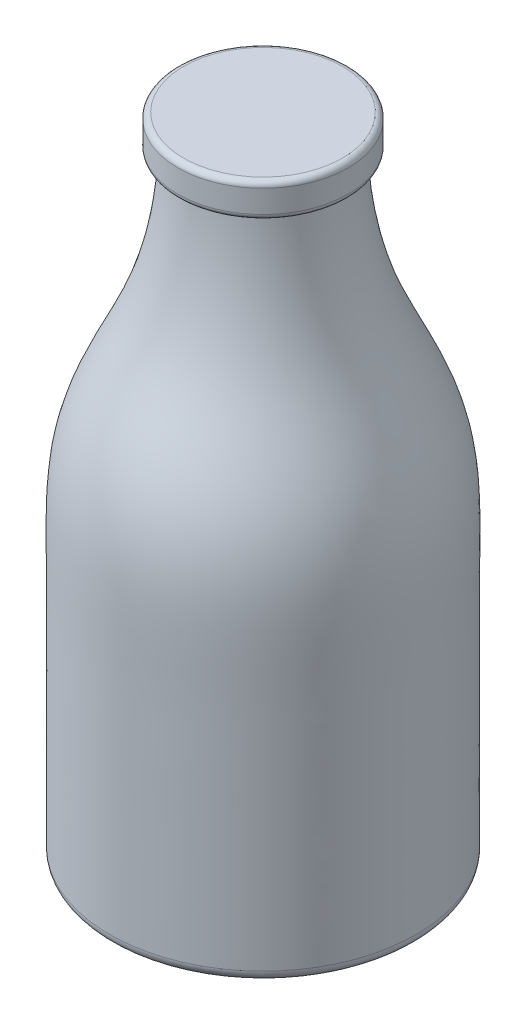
ISO-10303-21;
HEADER;
FILE_DESCRIPTION(('STEP AP214'),'2;1');
FILE_NAME('part.step','',(''),(''),'','','');
FILE_SCHEMA(('AUTOMOTIVE_DESIGN { 1 0 10303 214 1 1 1 1 }'));
ENDSEC;
DATA;
#1=APPLICATION_CONTEXT('core data for automotive mechanical design processes');
#2=APPLICATION_PROTOCOL_DEFINITION('international standard','automotive_design',2000,#1);
#3=PRODUCT_CONTEXT('',#1,'mechanical');
#4=PRODUCT('Part','Part','',(#3));
#5=PRODUCT_RELATED_PRODUCT_CATEGORY('part','',(#4));
#6=PRODUCT_DEFINITION_FORMATION('','',#4);
#7=PRODUCT_DEFINITION_CONTEXT('part definition',#1,'design');
#8=PRODUCT_DEFINITION('design','',#6,#7);
#9=PRODUCT_DEFINITION_SHAPE('','',#8);
#10=(LENGTH_UNIT() NAMED_UNIT(*) SI_UNIT(.MILLI.,.METRE.));
#11=(NAMED_UNIT(*) PLANE_ANGLE_UNIT() SI_UNIT($,.RADIAN.));
#12=(NAMED_UNIT(*) SI_UNIT($,.STERADIAN.) SOLID_ANGLE_UNIT());
#13=UNCERTAINTY_MEASURE_WITH_UNIT(LENGTH_MEASURE(1.E-05),#10,'distance_accuracy_value','');
#14=(GEOMETRIC_REPRESENTATION_CONTEXT(3) GLOBAL_UNCERTAINTY_ASSIGNED_CONTEXT((#13)) GLOBAL_UNIT_ASSIGNED_CONTEXT((#10,
#11,#12)) REPRESENTATION_CONTEXT('',''));
#15=CARTESIAN_POINT('',(0.,0.,0.));
#16=DIRECTION('',(0.,0.,1.));
#17=DIRECTION('',(1.,0.,0.));
#18=AXIS2_PLACEMENT_3D('',#15,#16,#17);
#19=CARTESIAN_POINT('',(25.,0.,0.));
#20=DIRECTION('',(0.,-1.,0.));
#21=DIRECTION('',(0.,0.,-1.));
#22=AXIS2_PLACEMENT_3D('',#19,#20,#21);
#23=PLANE('',#22);
#24=CARTESIAN_POINT('',(0.,0.,0.));
#25=DIRECTION('',(0.,-1.,0.));
#26=DIRECTION('',(0.,0.,-1.));
#27=AXIS2_PLACEMENT_3D('',#24,#25,#26);
#28=CIRCLE('',#27,25.);
#29=CARTESIAN_POINT('',(0.,0.,-25.));
#30=VERTEX_POINT('',#29);
#31=EDGE_CURVE('E70',#30,#30,#28,.T.);
#32=ORIENTED_EDGE('',*,*,#31,.T.);
#33=EDGE_LOOP('',(#32));
#34=FACE_BOUND('',#33,.T.);
#35=ADVANCED_FACE('F39',(#34),#23,.T.);
#36=CARTESIAN_POINT('',(0.,114.,0.));
#37=DIRECTION('',(0.,1.,0.));
#38=DIRECTION('',(0.,0.,1.));
#39=AXIS2_PLACEMENT_3D('',#36,#37,#38);
#40=PLANE('',#39);
#41=CARTESIAN_POINT('',(0.,114.,0.));
#42=DIRECTION('',(0.,-1.,0.));
#43=DIRECTION('',(0.,0.,-1.));
#44=AXIS2_PLACEMENT_3D('',#41,#42,#43);
#45=CIRCLE('',#44,14.);
#46=CARTESIAN_POINT('',(0.,114.,-14.));
#47=VERTEX_POINT('',#46);
#48=EDGE_CURVE('E10',#47,#47,#45,.T.);
#49=ORIENTED_EDGE('',*,*,#48,.F.);
#50=EDGE_LOOP('',(#49));
#51=FACE_BOUND('',#50,.T.);
#52=ADVANCED_FACE('F100',(#51),#40,.T.);
#53=CARTESIAN_POINT('',(0.,113.,0.));
#54=DIRECTION('',(0.,-1.,0.));
#55=DIRECTION('',(0.,0.,-1.));
#56=AXIS2_PLACEMENT_3D('',#53,#54,#55);
#57=TOROIDAL_SURFACE('',#56,14.,0.999999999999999);
#58=ORIENTED_EDGE('',*,*,#48,.T.);
#59=EDGE_LOOP('',(#58));
#60=FACE_BOUND('',#59,.T.);
#61=CARTESIAN_POINT('',(0.,113.,0.));
#62=DIRECTION('',(0.,-1.,0.));
#63=DIRECTION('',(0.,0.,-1.));
#64=AXIS2_PLACEMENT_3D('',#61,#62,#63);
#65=CIRCLE('',#64,15.);
#66=CARTESIAN_POINT('',(0.,113.,-15.));
#67=VERTEX_POINT('',#66);
#68=EDGE_CURVE('E46',#67,#67,#65,.T.);
#69=ORIENTED_EDGE('',*,*,#68,.F.);
#70=EDGE_LOOP('',(#69));
#71=FACE_BOUND('',#70,.T.);
#72=ADVANCED_FACE('F98',(#60,#71),#57,.T.);
#73=CARTESIAN_POINT('',(0.,0.,0.));
#74=DIRECTION('',(0.,-1.,0.));
#75=DIRECTION('',(0.,0.,-1.));
#76=AXIS2_PLACEMENT_3D('',#73,#74,#75);
#77=CYLINDRICAL_SURFACE('',#76,15.);
#78=ORIENTED_EDGE('',*,*,#68,.T.);
#79=EDGE_LOOP('',(#78));
#80=FACE_BOUND('',#79,.T.);
#81=CARTESIAN_POINT('',(0.,109.,0.));
#82=DIRECTION('',(0.,-1.,0.));
#83=DIRECTION('',(0.,0.,-1.));
#84=AXIS2_PLACEMENT_3D('',#81,#82,#83);
#85=CIRCLE('',#84,15.);
#86=CARTESIAN_POINT('',(0.,109.,-15.));
#87=VERTEX_POINT('',#86);
#88=EDGE_CURVE('E51',#87,#87,#85,.T.);
#89=ORIENTED_EDGE('',*,*,#88,.F.);
#90=EDGE_LOOP('',(#89));
#91=FACE_BOUND('',#90,.T.);
#92=ADVANCED_FACE('F94',(#80,#91),#77,.T.);
#93=CARTESIAN_POINT('',(0.,109.,0.));
#94=DIRECTION('',(0.,-1.,0.));
#95=DIRECTION('',(0.,0.,-1.));
#96=AXIS2_PLACEMENT_3D('',#93,#94,#95);
#97=TOROIDAL_SURFACE('',#96,14.,1.);
#98=ORIENTED_EDGE('',*,*,#88,.T.);
#99=EDGE_LOOP('',(#98));
#100=FACE_BOUND('',#99,.T.);
#101=CARTESIAN_POINT('',(0.,108.,0.));
#102=DIRECTION('',(0.,-1.,0.));
#103=DIRECTION('',(0.,0.,-1.));
#104=AXIS2_PLACEMENT_3D('',#101,#102,#103);
#105=CIRCLE('',#104,14.);
#106=CARTESIAN_POINT('',(0.,108.,-14.));
#107=VERTEX_POINT('',#106);
#108=EDGE_CURVE('E56',#107,#107,#105,.T.);
#109=ORIENTED_EDGE('',*,*,#108,.F.);
#110=EDGE_LOOP('',(#109));
#111=FACE_BOUND('',#110,.T.);
#112=ADVANCED_FACE('F90',(#100,#111),#97,.T.);
#113=CARTESIAN_POINT('',(13.0351818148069,108.,0.));
#114=DIRECTION('',(0.,-1.,0.));
#115=DIRECTION('',(0.,0.,-1.));
#116=AXIS2_PLACEMENT_3D('',#113,#114,#115);
#117=PLANE('',#116);
#118=ORIENTED_EDGE('',*,*,#108,.T.);
#119=EDGE_LOOP('',(#118));
#120=FACE_BOUND('',#119,.T.);
#121=CARTESIAN_POINT('',(0.,108.,0.));
#122=DIRECTION('',(0.,-1.,0.));
#123=DIRECTION('',(0.,0.,-1.));
#124=AXIS2_PLACEMENT_3D('',#121,#122,#123);
#125=CIRCLE('',#124,13.0351818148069);
#126=CARTESIAN_POINT('',(0.,108.,-13.0351818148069));
#127=VERTEX_POINT('',#126);
#128=EDGE_CURVE('E62',#127,#127,#125,.T.);
#129=ORIENTED_EDGE('',*,*,#128,.F.);
#130=EDGE_LOOP('',(#129));
#131=FACE_BOUND('',#130,.T.);
#132=ADVANCED_FACE('F86',(#120,#131),#117,.T.);
#133=CARTESIAN_POINT('',(27.,1.99999999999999,0.));
#134=CARTESIAN_POINT('',(27.0084861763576,10.6491047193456,0.));
#135=CARTESIAN_POINT('',(26.9941066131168,21.1026384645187,0.));
#136=CARTESIAN_POINT('',(27.0048942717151,35.2286330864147,0.));
#137=CARTESIAN_POINT('',(26.9610536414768,43.8774217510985,0.));
#138=CARTESIAN_POINT('',(27.0999986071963,52.5708636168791,0.));
#139=CARTESIAN_POINT('',(26.752535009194,60.383271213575,0.));
#140=CARTESIAN_POINT('',(25.1958446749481,68.1484428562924,0.));
#141=CARTESIAN_POINT('',(21.4742133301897,76.4118757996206,0.));
#142=CARTESIAN_POINT('',(15.2260206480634,89.10466804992,0.));
#143=CARTESIAN_POINT('',(13.3284306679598,100.144153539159,0.));
#144=CARTESIAN_POINT('',(13.0351818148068,108.,0.));
#145=B_SPLINE_CURVE_WITH_KNOTS('',3,(#133,#134,#135,#136,#137,#138,#139,#140,#141,#142,#143,
#144),.UNSPECIFIED.,.F.,.F.,(4,1,1,1,1,1,1,1,1,4),(0.,0.239735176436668,0.289754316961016,
0.391543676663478,0.479470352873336,0.530696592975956,0.608146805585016,0.697106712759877,
0.780980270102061,1.),.UNSPECIFIED.);
#146=CARTESIAN_POINT('',(0.,0.,0.));
#147=DIRECTION('',(0.,-1.,0.));
#148=AXIS1_PLACEMENT('',#146,#147);
#149=SURFACE_OF_REVOLUTION('',#145,#148);
#150=ORIENTED_EDGE('',*,*,#128,.T.);
#151=EDGE_LOOP('',(#150));
#152=FACE_BOUND('',#151,.T.);
#153=CARTESIAN_POINT('',(0.,1.99999999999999,0.));
#154=DIRECTION('',(0.,-1.,0.));
#155=DIRECTION('',(0.,0.,-1.));
#156=AXIS2_PLACEMENT_3D('',#153,#154,#155);
#157=CIRCLE('',#156,27.);
#158=CARTESIAN_POINT('',(0.,1.99999999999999,-27.));
#159=VERTEX_POINT('',#158);
#160=EDGE_CURVE('E66',#159,#159,#157,.T.);
#161=ORIENTED_EDGE('',*,*,#160,.F.);
#162=EDGE_LOOP('',(#161));
#163=FACE_BOUND('',#162,.T.);
#164=ADVANCED_FACE('F81',(#152,#163),#149,.F.);
#165=CARTESIAN_POINT('',(0.,2.,0.));
#166=DIRECTION('',(0.,-1.,0.));
#167=DIRECTION('',(0.,0.,-1.));
#168=AXIS2_PLACEMENT_3D('',#165,#166,#167);
#169=TOROIDAL_SURFACE('',#168,25.,2.);
#170=ORIENTED_EDGE('',*,*,#160,.T.);
#171=EDGE_LOOP('',(#170));
#172=FACE_BOUND('',#171,.T.);
#173=ORIENTED_EDGE('',*,*,#31,.F.);
#174=EDGE_LOOP('',(#173));
#175=FACE_BOUND('',#174,.T.);
#176=ADVANCED_FACE('F85',(#172,#175),#169,.T.);
#177=CLOSED_SHELL('',(#35,#52,#72,#92,#112,#132,#164,#176));
#178=MANIFOLD_SOLID_BREP('B2',#177);
#179=ADVANCED_BREP_SHAPE_REPRESENTATION('',(#18,#178),#14);
#180=SHAPE_DEFINITION_REPRESENTATION(#9,#179);
ENDSEC;
END-ISO-10303-21;
